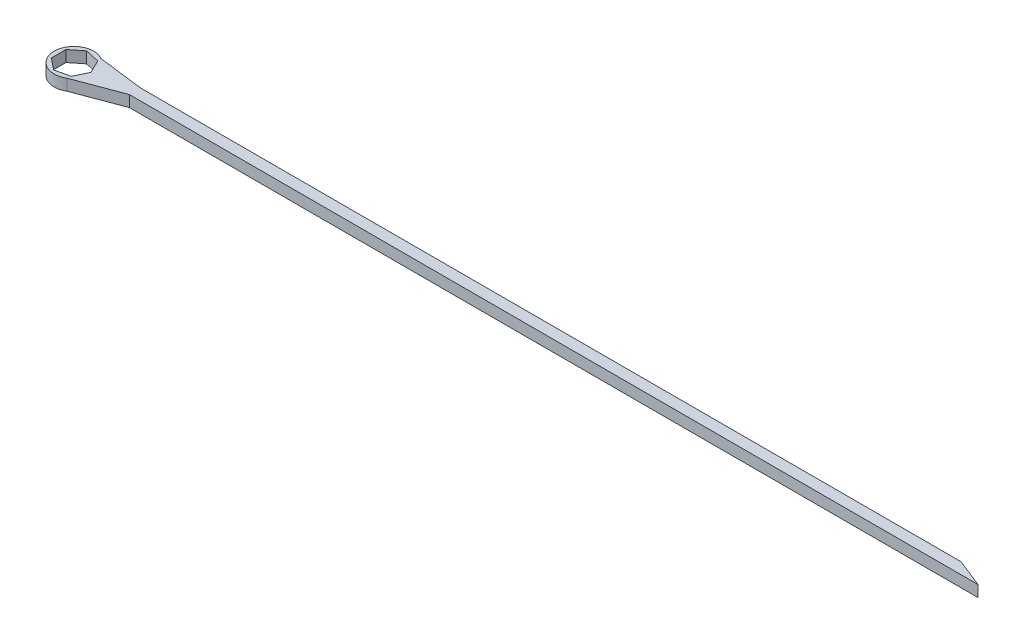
from build123d import *

# Parameters (mm, degrees)
BOSS_EXTRUDE1_DEPTH = 1


with BuildPart() as part:
    # Sketch1 → Boss-Extrude1 (new body)
    with BuildSketch(Plane(origin=(0, 0, 0), x_dir=(1, 0, 0), z_dir=(0, 1, 0))):
        with BuildLine():
            Line((4.901387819, 0), (80, 0))
            Line((80, 0), (77.5, 1))
            Line((77.5, 1), (4.901387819, 1))
            Line((4.901387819, 1), (0.901387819, 1.5))
            ThreePointArc((0.901387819, 1.5), (-1.75, 0), (0.901387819, -1.5))
            Line((0.901387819, -1.5), (4.901387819, 0))
        make_face()
        Polygon((1.5, 0), (0.935234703, 1.172747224), (-0.333781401, 1.462391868), (-1.351453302, 0.650825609), (-1.351453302, -0.650825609), (-0.333781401, -1.462391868), (0.935234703, -1.172747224), align=None, mode=Mode.SUBTRACT)
    extrude(amount=BOSS_EXTRUDE1_DEPTH)


solid = part.part
